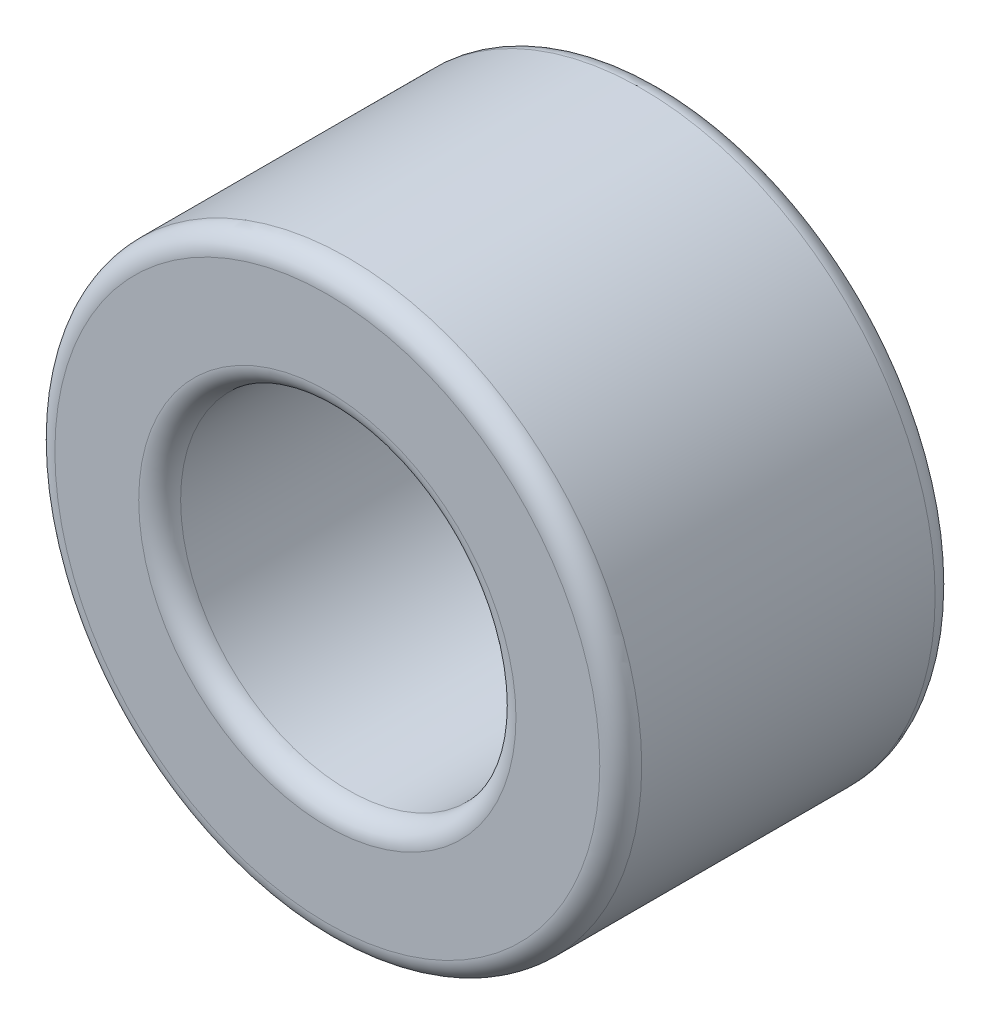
ISO-10303-21;
HEADER;
FILE_DESCRIPTION(('STEP AP214'),'2;1');
FILE_NAME('part.step','',(''),(''),'','','');
FILE_SCHEMA(('AUTOMOTIVE_DESIGN { 1 0 10303 214 1 1 1 1 }'));
ENDSEC;
DATA;
#1=APPLICATION_CONTEXT('core data for automotive mechanical design processes');
#2=APPLICATION_PROTOCOL_DEFINITION('international standard','automotive_design',2000,#1);
#3=PRODUCT_CONTEXT('',#1,'mechanical');
#4=PRODUCT('Part','Part','',(#3));
#5=PRODUCT_RELATED_PRODUCT_CATEGORY('part','',(#4));
#6=PRODUCT_DEFINITION_FORMATION('','',#4);
#7=PRODUCT_DEFINITION_CONTEXT('part definition',#1,'design');
#8=PRODUCT_DEFINITION('design','',#6,#7);
#9=PRODUCT_DEFINITION_SHAPE('','',#8);
#10=(LENGTH_UNIT() NAMED_UNIT(*) SI_UNIT(.MILLI.,.METRE.));
#11=(NAMED_UNIT(*) PLANE_ANGLE_UNIT() SI_UNIT($,.RADIAN.));
#12=(NAMED_UNIT(*) SI_UNIT($,.STERADIAN.) SOLID_ANGLE_UNIT());
#13=UNCERTAINTY_MEASURE_WITH_UNIT(LENGTH_MEASURE(1.E-05),#10,'distance_accuracy_value','');
#14=(GEOMETRIC_REPRESENTATION_CONTEXT(3) GLOBAL_UNCERTAINTY_ASSIGNED_CONTEXT((#13)) GLOBAL_UNIT_ASSIGNED_CONTEXT((#10,
#11,#12)) REPRESENTATION_CONTEXT('',''));
#15=CARTESIAN_POINT('',(0.,0.,0.));
#16=DIRECTION('',(0.,0.,1.));
#17=DIRECTION('',(1.,0.,0.));
#18=AXIS2_PLACEMENT_3D('',#15,#16,#17);
#19=CARTESIAN_POINT('',(0.,7.,4.));
#20=DIRECTION('',(0.,0.,-1.));
#21=DIRECTION('',(-1.,0.,0.));
#22=AXIS2_PLACEMENT_3D('',#19,#20,#21);
#23=PLANE('',#22);
#24=CARTESIAN_POINT('',(0.,0.,4.));
#25=DIRECTION('',(0.,0.,-1.));
#26=DIRECTION('',(-1.,0.,0.));
#27=AXIS2_PLACEMENT_3D('',#24,#25,#26);
#28=CIRCLE('',#27,6.5);
#29=CARTESIAN_POINT('',(-6.5,0.,4.));
#30=VERTEX_POINT('',#29);
#31=EDGE_CURVE('E40',#30,#30,#28,.F.);
#32=ORIENTED_EDGE('',*,*,#31,.T.);
#33=EDGE_LOOP('',(#32));
#34=FACE_BOUND('',#33,.T.);
#35=CARTESIAN_POINT('',(0.,0.,4.));
#36=DIRECTION('',(0.,0.,-1.));
#37=DIRECTION('',(-1.,0.,0.));
#38=AXIS2_PLACEMENT_3D('',#35,#36,#37);
#39=CIRCLE('',#38,4.5);
#40=CARTESIAN_POINT('',(-4.5,0.,4.));
#41=VERTEX_POINT('',#40);
#42=EDGE_CURVE('E44',#41,#41,#39,.T.);
#43=ORIENTED_EDGE('',*,*,#42,.T.);
#44=EDGE_LOOP('',(#43));
#45=FACE_BOUND('',#44,.T.);
#46=ADVANCED_FACE('F29',(#34,#45),#23,.F.);
#47=CARTESIAN_POINT('',(0.,0.,4.));
#48=DIRECTION('',(0.,0.,1.));
#49=DIRECTION('',(1.,0.,0.));
#50=AXIS2_PLACEMENT_3D('',#47,#48,#49);
#51=CYLINDRICAL_SURFACE('',#50,4.);
#52=CARTESIAN_POINT('',(0.,0.,3.5));
#53=DIRECTION('',(0.,0.,-1.));
#54=DIRECTION('',(-1.,0.,0.));
#55=AXIS2_PLACEMENT_3D('',#52,#53,#54);
#56=CIRCLE('',#55,4.);
#57=CARTESIAN_POINT('',(-4.,0.,3.5));
#58=VERTEX_POINT('',#57);
#59=EDGE_CURVE('E10',#58,#58,#56,.F.);
#60=ORIENTED_EDGE('',*,*,#59,.T.);
#61=EDGE_LOOP('',(#60));
#62=FACE_BOUND('',#61,.T.);
#63=CARTESIAN_POINT('',(0.,0.,-3.5));
#64=DIRECTION('',(0.,0.,1.));
#65=DIRECTION('',(1.,0.,0.));
#66=AXIS2_PLACEMENT_3D('',#63,#64,#65);
#67=CIRCLE('',#66,4.);
#68=CARTESIAN_POINT('',(4.,0.,-3.5));
#69=VERTEX_POINT('',#68);
#70=EDGE_CURVE('E36',#69,#69,#67,.F.);
#71=ORIENTED_EDGE('',*,*,#70,.T.);
#72=EDGE_LOOP('',(#71));
#73=FACE_BOUND('',#72,.T.);
#74=ADVANCED_FACE('F74',(#62,#73),#51,.F.);
#75=CARTESIAN_POINT('',(0.,4.,-4.));
#76=DIRECTION('',(0.,0.,1.));
#77=DIRECTION('',(1.,0.,0.));
#78=AXIS2_PLACEMENT_3D('',#75,#76,#77);
#79=PLANE('',#78);
#80=CARTESIAN_POINT('',(0.,0.,-4.));
#81=DIRECTION('',(0.,0.,1.));
#82=DIRECTION('',(1.,0.,0.));
#83=AXIS2_PLACEMENT_3D('',#80,#81,#82);
#84=CIRCLE('',#83,6.5);
#85=CARTESIAN_POINT('',(6.5,0.,-4.));
#86=VERTEX_POINT('',#85);
#87=EDGE_CURVE('E49',#86,#86,#84,.F.);
#88=ORIENTED_EDGE('',*,*,#87,.T.);
#89=EDGE_LOOP('',(#88));
#90=FACE_BOUND('',#89,.T.);
#91=CARTESIAN_POINT('',(0.,0.,-4.));
#92=DIRECTION('',(0.,0.,1.));
#93=DIRECTION('',(1.,0.,0.));
#94=AXIS2_PLACEMENT_3D('',#91,#92,#93);
#95=CIRCLE('',#94,4.5);
#96=CARTESIAN_POINT('',(4.5,0.,-4.));
#97=VERTEX_POINT('',#96);
#98=EDGE_CURVE('E52',#97,#97,#95,.T.);
#99=ORIENTED_EDGE('',*,*,#98,.T.);
#100=EDGE_LOOP('',(#99));
#101=FACE_BOUND('',#100,.T.);
#102=ADVANCED_FACE('F90',(#90,#101),#79,.F.);
#103=CARTESIAN_POINT('',(0.,0.,4.));
#104=DIRECTION('',(0.,0.,1.));
#105=DIRECTION('',(1.,0.,0.));
#106=AXIS2_PLACEMENT_3D('',#103,#104,#105);
#107=CYLINDRICAL_SURFACE('',#106,7.);
#108=CARTESIAN_POINT('',(0.,0.,-3.5));
#109=DIRECTION('',(0.,0.,1.));
#110=DIRECTION('',(1.,0.,0.));
#111=AXIS2_PLACEMENT_3D('',#108,#109,#110);
#112=CIRCLE('',#111,7.);
#113=CARTESIAN_POINT('',(7.,0.,-3.5));
#114=VERTEX_POINT('',#113);
#115=EDGE_CURVE('E55',#114,#114,#112,.T.);
#116=ORIENTED_EDGE('',*,*,#115,.T.);
#117=EDGE_LOOP('',(#116));
#118=FACE_BOUND('',#117,.T.);
#119=CARTESIAN_POINT('',(0.,0.,3.5));
#120=DIRECTION('',(0.,0.,-1.));
#121=DIRECTION('',(-1.,0.,0.));
#122=AXIS2_PLACEMENT_3D('',#119,#120,#121);
#123=CIRCLE('',#122,7.);
#124=CARTESIAN_POINT('',(-7.,0.,3.5));
#125=VERTEX_POINT('',#124);
#126=EDGE_CURVE('E58',#125,#125,#123,.T.);
#127=ORIENTED_EDGE('',*,*,#126,.T.);
#128=EDGE_LOOP('',(#127));
#129=FACE_BOUND('',#128,.T.);
#130=ADVANCED_FACE('F62',(#118,#129),#107,.T.);
#131=CARTESIAN_POINT('',(0.,0.,-3.5));
#132=DIRECTION('',(0.,0.,1.));
#133=DIRECTION('',(1.,0.,0.));
#134=AXIS2_PLACEMENT_3D('',#131,#132,#133);
#135=TOROIDAL_SURFACE('',#134,6.5,0.5);
#136=ORIENTED_EDGE('',*,*,#87,.F.);
#137=EDGE_LOOP('',(#136));
#138=FACE_BOUND('',#137,.T.);
#139=ORIENTED_EDGE('',*,*,#115,.F.);
#140=EDGE_LOOP('',(#139));
#141=FACE_BOUND('',#140,.T.);
#142=ADVANCED_FACE('F68',(#138,#141),#135,.T.);
#143=CARTESIAN_POINT('',(0.,0.,3.5));
#144=DIRECTION('',(0.,0.,-1.));
#145=DIRECTION('',(-1.,0.,0.));
#146=AXIS2_PLACEMENT_3D('',#143,#144,#145);
#147=TOROIDAL_SURFACE('',#146,6.5,0.5);
#148=ORIENTED_EDGE('',*,*,#126,.F.);
#149=EDGE_LOOP('',(#148));
#150=FACE_BOUND('',#149,.T.);
#151=ORIENTED_EDGE('',*,*,#31,.F.);
#152=EDGE_LOOP('',(#151));
#153=FACE_BOUND('',#152,.T.);
#154=ADVANCED_FACE('F64',(#150,#153),#147,.T.);
#155=CARTESIAN_POINT('',(0.,0.,3.5));
#156=DIRECTION('',(0.,0.,-1.));
#157=DIRECTION('',(-1.,0.,0.));
#158=AXIS2_PLACEMENT_3D('',#155,#156,#157);
#159=TOROIDAL_SURFACE('',#158,4.5,0.5);
#160=ORIENTED_EDGE('',*,*,#42,.F.);
#161=EDGE_LOOP('',(#160));
#162=FACE_BOUND('',#161,.T.);
#163=ORIENTED_EDGE('',*,*,#59,.F.);
#164=EDGE_LOOP('',(#163));
#165=FACE_BOUND('',#164,.T.);
#166=ADVANCED_FACE('F67',(#162,#165),#159,.T.);
#167=CARTESIAN_POINT('',(0.,0.,-3.5));
#168=DIRECTION('',(0.,0.,1.));
#169=DIRECTION('',(1.,0.,0.));
#170=AXIS2_PLACEMENT_3D('',#167,#168,#169);
#171=TOROIDAL_SURFACE('',#170,4.5,0.5);
#172=ORIENTED_EDGE('',*,*,#70,.F.);
#173=EDGE_LOOP('',(#172));
#174=FACE_BOUND('',#173,.T.);
#175=ORIENTED_EDGE('',*,*,#98,.F.);
#176=EDGE_LOOP('',(#175));
#177=FACE_BOUND('',#176,.T.);
#178=ADVANCED_FACE('F31',(#174,#177),#171,.T.);
#179=CLOSED_SHELL('',(#46,#74,#102,#130,#142,#154,#166,#178));
#180=MANIFOLD_SOLID_BREP('B2',#179);
#181=ADVANCED_BREP_SHAPE_REPRESENTATION('',(#18,#180),#14);
#182=SHAPE_DEFINITION_REPRESENTATION(#9,#181);
ENDSEC;
END-ISO-10303-21;
